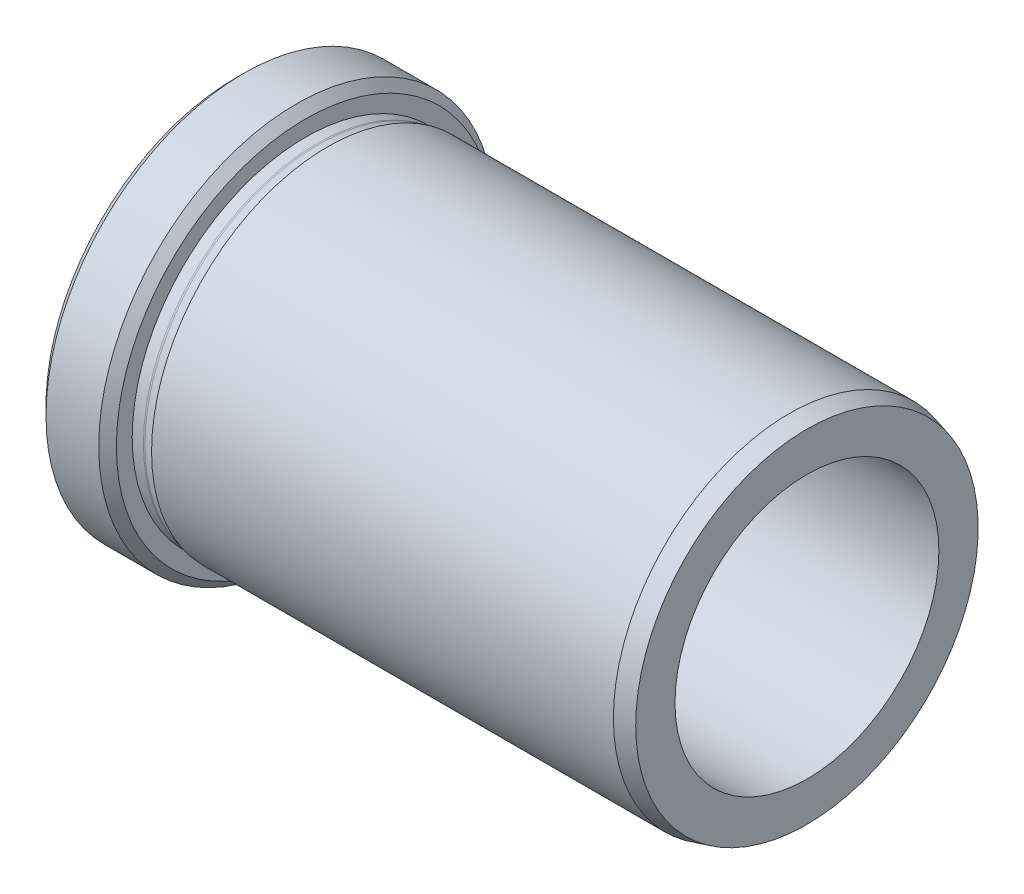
ISO-10303-21;
HEADER;
FILE_DESCRIPTION(('STEP AP214'),'2;1');
FILE_NAME('part.step','',(''),(''),'','','');
FILE_SCHEMA(('AUTOMOTIVE_DESIGN { 1 0 10303 214 1 1 1 1 }'));
ENDSEC;
DATA;
#1=APPLICATION_CONTEXT('core data for automotive mechanical design processes');
#2=APPLICATION_PROTOCOL_DEFINITION('international standard','automotive_design',2000,#1);
#3=PRODUCT_CONTEXT('',#1,'mechanical');
#4=PRODUCT('Part','Part','',(#3));
#5=PRODUCT_RELATED_PRODUCT_CATEGORY('part','',(#4));
#6=PRODUCT_DEFINITION_FORMATION('','',#4);
#7=PRODUCT_DEFINITION_CONTEXT('part definition',#1,'design');
#8=PRODUCT_DEFINITION('design','',#6,#7);
#9=PRODUCT_DEFINITION_SHAPE('','',#8);
#10=(LENGTH_UNIT() NAMED_UNIT(*) SI_UNIT(.MILLI.,.METRE.));
#11=(NAMED_UNIT(*) PLANE_ANGLE_UNIT() SI_UNIT($,.RADIAN.));
#12=(NAMED_UNIT(*) SI_UNIT($,.STERADIAN.) SOLID_ANGLE_UNIT());
#13=UNCERTAINTY_MEASURE_WITH_UNIT(LENGTH_MEASURE(1.E-05),#10,'distance_accuracy_value','');
#14=(GEOMETRIC_REPRESENTATION_CONTEXT(3) GLOBAL_UNCERTAINTY_ASSIGNED_CONTEXT((#13)) GLOBAL_UNIT_ASSIGNED_CONTEXT((#10,
#11,#12)) REPRESENTATION_CONTEXT('',''));
#15=CARTESIAN_POINT('',(0.,0.,0.));
#16=DIRECTION('',(0.,0.,1.));
#17=DIRECTION('',(1.,0.,0.));
#18=AXIS2_PLACEMENT_3D('',#15,#16,#17);
#19=CARTESIAN_POINT('',(20.075539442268,0.,0.));
#20=DIRECTION('',(-1.,0.,0.));
#21=DIRECTION('',(0.,0.,1.));
#22=AXIS2_PLACEMENT_3D('',#19,#20,#21);
#23=TOROIDAL_SURFACE('',#22,20.5,0.8);
#24=CARTESIAN_POINT('',(20.075539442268,0.,0.));
#25=DIRECTION('',(-1.,0.,0.));
#26=DIRECTION('',(0.,0.,1.));
#27=AXIS2_PLACEMENT_3D('',#24,#25,#26);
#28=CIRCLE('',#27,19.7);
#29=CARTESIAN_POINT('',(20.075539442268,0.,19.7));
#30=VERTEX_POINT('',#29);
#31=EDGE_CURVE('E58',#30,#30,#28,.T.);
#32=ORIENTED_EDGE('',*,*,#31,.F.);
#33=EDGE_LOOP('',(#32));
#34=FACE_BOUND('',#33,.T.);
#35=CARTESIAN_POINT('',(20.28259467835,0.,0.));
#36=DIRECTION('',(-1.,0.,0.));
#37=DIRECTION('',(0.,0.,1.));
#38=AXIS2_PLACEMENT_3D('',#35,#36,#37);
#39=CIRCLE('',#38,19.7272593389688);
#40=CARTESIAN_POINT('',(20.28259467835,0.,19.7272593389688));
#41=VERTEX_POINT('',#40);
#42=EDGE_CURVE('E40',#41,#41,#39,.T.);
#43=ORIENTED_EDGE('',*,*,#42,.T.);
#44=EDGE_LOOP('',(#43));
#45=FACE_BOUND('',#44,.T.);
#46=ADVANCED_FACE('F14',(#34,#45),#23,.F.);
#47=CARTESIAN_POINT('',(21.3004766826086,0.,0.));
#48=DIRECTION('',(1.,0.,0.));
#49=DIRECTION('',(0.,0.,-1.));
#50=AXIS2_PLACEMENT_3D('',#47,#48,#49);
#51=CONICAL_SURFACE('',#50,20.,0.261799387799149);
#52=ORIENTED_EDGE('',*,*,#42,.F.);
#53=EDGE_LOOP('',(#52));
#54=FACE_BOUND('',#53,.T.);
#55=CARTESIAN_POINT('',(21.3004766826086,0.,0.));
#56=DIRECTION('',(-1.,0.,0.));
#57=DIRECTION('',(0.,0.,1.));
#58=AXIS2_PLACEMENT_3D('',#55,#56,#57);
#59=CIRCLE('',#58,20.);
#60=CARTESIAN_POINT('',(21.3004766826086,0.,20.));
#61=VERTEX_POINT('',#60);
#62=EDGE_CURVE('E43',#61,#61,#59,.T.);
#63=ORIENTED_EDGE('',*,*,#62,.T.);
#64=EDGE_LOOP('',(#63));
#65=FACE_BOUND('',#64,.T.);
#66=ADVANCED_FACE('F66',(#54,#65),#51,.T.);
#67=CARTESIAN_POINT('',(0.,0.,0.));
#68=DIRECTION('',(-1.,0.,0.));
#69=DIRECTION('',(0.,0.,1.));
#70=AXIS2_PLACEMENT_3D('',#67,#68,#69);
#71=CYLINDRICAL_SURFACE('',#70,20.);
#72=ORIENTED_EDGE('',*,*,#62,.F.);
#73=EDGE_LOOP('',(#72));
#74=FACE_BOUND('',#73,.T.);
#75=CARTESIAN_POINT('',(73.8004766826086,0.,0.));
#76=DIRECTION('',(-1.,0.,0.));
#77=DIRECTION('',(0.,0.,1.));
#78=AXIS2_PLACEMENT_3D('',#75,#76,#77);
#79=CIRCLE('',#78,20.);
#80=CARTESIAN_POINT('',(73.8004766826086,0.,20.));
#81=VERTEX_POINT('',#80);
#82=EDGE_CURVE('E46',#81,#81,#79,.T.);
#83=ORIENTED_EDGE('',*,*,#82,.T.);
#84=EDGE_LOOP('',(#83));
#85=FACE_BOUND('',#84,.T.);
#86=ADVANCED_FACE('F72',(#74,#85),#71,.T.);
#87=CARTESIAN_POINT('',(75.8004766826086,0.,0.));
#88=DIRECTION('',(-1.,0.,0.));
#89=DIRECTION('',(0.,0.,1.));
#90=AXIS2_PLACEMENT_3D('',#87,#88,#89);
#91=CONICAL_SURFACE('',#90,19.4641016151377,0.261799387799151);
#92=ORIENTED_EDGE('',*,*,#82,.F.);
#93=EDGE_LOOP('',(#92));
#94=FACE_BOUND('',#93,.T.);
#95=CARTESIAN_POINT('',(75.8004766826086,0.,0.));
#96=DIRECTION('',(-1.,0.,0.));
#97=DIRECTION('',(0.,0.,1.));
#98=AXIS2_PLACEMENT_3D('',#95,#96,#97);
#99=CIRCLE('',#98,19.4641016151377);
#100=CARTESIAN_POINT('',(75.8004766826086,0.,19.4641016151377));
#101=VERTEX_POINT('',#100);
#102=EDGE_CURVE('E49',#101,#101,#99,.T.);
#103=ORIENTED_EDGE('',*,*,#102,.T.);
#104=EDGE_LOOP('',(#103));
#105=FACE_BOUND('',#104,.T.);
#106=ADVANCED_FACE('F78',(#94,#105),#91,.T.);
#107=CARTESIAN_POINT('',(75.8004766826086,19.4641016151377,0.));
#108=DIRECTION('',(-1.,0.,0.));
#109=DIRECTION('',(0.,0.,1.));
#110=AXIS2_PLACEMENT_3D('',#107,#108,#109);
#111=PLANE('',#110);
#112=ORIENTED_EDGE('',*,*,#102,.F.);
#113=EDGE_LOOP('',(#112));
#114=FACE_BOUND('',#113,.T.);
#115=CARTESIAN_POINT('',(75.8004766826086,0.,0.));
#116=DIRECTION('',(-1.,0.,0.));
#117=DIRECTION('',(0.,0.,1.));
#118=AXIS2_PLACEMENT_3D('',#115,#116,#117);
#119=CIRCLE('',#118,15.);
#120=CARTESIAN_POINT('',(75.8004766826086,0.,15.));
#121=VERTEX_POINT('',#120);
#122=EDGE_CURVE('E52',#121,#121,#119,.T.);
#123=ORIENTED_EDGE('',*,*,#122,.T.);
#124=EDGE_LOOP('',(#123));
#125=FACE_BOUND('',#124,.T.);
#126=ADVANCED_FACE('F84',(#114,#125),#111,.F.);
#127=CARTESIAN_POINT('',(0.,0.,0.));
#128=DIRECTION('',(-1.,0.,0.));
#129=DIRECTION('',(0.,0.,1.));
#130=AXIS2_PLACEMENT_3D('',#127,#128,#129);
#131=CYLINDRICAL_SURFACE('',#130,15.);
#132=CARTESIAN_POINT('',(12.3004766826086,0.,0.));
#133=DIRECTION('',(1.,0.,0.));
#134=DIRECTION('',(0.,0.,-1.));
#135=AXIS2_PLACEMENT_3D('',#132,#133,#134);
#136=CIRCLE('',#135,15.);
#137=CARTESIAN_POINT('',(12.3004766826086,0.,-15.));
#138=VERTEX_POINT('',#137);
#139=EDGE_CURVE('E29',#138,#138,#136,.F.);
#140=ORIENTED_EDGE('',*,*,#139,.T.);
#141=EDGE_LOOP('',(#140));
#142=FACE_BOUND('',#141,.T.);
#143=ORIENTED_EDGE('',*,*,#122,.F.);
#144=EDGE_LOOP('',(#143));
#145=FACE_BOUND('',#144,.T.);
#146=ADVANCED_FACE('F90',(#142,#145),#131,.F.);
#147=CARTESIAN_POINT('',(10.8004766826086,22.5,0.));
#148=DIRECTION('',(1.,0.,0.));
#149=DIRECTION('',(0.,0.,-1.));
#150=AXIS2_PLACEMENT_3D('',#147,#148,#149);
#151=PLANE('',#150);
#152=CARTESIAN_POINT('',(10.8004766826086,0.,0.));
#153=DIRECTION('',(1.,0.,0.));
#154=DIRECTION('',(0.,0.,-1.));
#155=AXIS2_PLACEMENT_3D('',#152,#153,#154);
#156=CIRCLE('',#155,16.5);
#157=CARTESIAN_POINT('',(10.8004766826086,0.,-16.5));
#158=VERTEX_POINT('',#157);
#159=EDGE_CURVE('E25',#158,#158,#156,.T.);
#160=ORIENTED_EDGE('',*,*,#159,.T.);
#161=EDGE_LOOP('',(#160));
#162=FACE_BOUND('',#161,.T.);
#163=CARTESIAN_POINT('',(10.8004766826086,0.,0.));
#164=DIRECTION('',(1.,0.,0.));
#165=DIRECTION('',(0.,0.,-1.));
#166=AXIS2_PLACEMENT_3D('',#163,#164,#165);
#167=CIRCLE('',#166,21.5);
#168=CARTESIAN_POINT('',(10.8004766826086,0.,-21.5));
#169=VERTEX_POINT('',#168);
#170=EDGE_CURVE('E37',#169,#169,#167,.F.);
#171=ORIENTED_EDGE('',*,*,#170,.T.);
#172=EDGE_LOOP('',(#171));
#173=FACE_BOUND('',#172,.T.);
#174=ADVANCED_FACE('F95',(#162,#173),#151,.F.);
#175=CARTESIAN_POINT('',(0.,0.,0.));
#176=DIRECTION('',(-1.,0.,0.));
#177=DIRECTION('',(0.,0.,1.));
#178=AXIS2_PLACEMENT_3D('',#175,#176,#177);
#179=CYLINDRICAL_SURFACE('',#178,22.5);
#180=CARTESIAN_POINT('',(17.8004766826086,0.,0.));
#181=DIRECTION('',(-1.,0.,0.));
#182=DIRECTION('',(0.,0.,1.));
#183=AXIS2_PLACEMENT_3D('',#180,#181,#182);
#184=CIRCLE('',#183,22.5);
#185=CARTESIAN_POINT('',(17.8004766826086,0.,22.5));
#186=VERTEX_POINT('',#185);
#187=EDGE_CURVE('E21',#186,#186,#184,.T.);
#188=ORIENTED_EDGE('',*,*,#187,.T.);
#189=EDGE_LOOP('',(#188));
#190=FACE_BOUND('',#189,.T.);
#191=CARTESIAN_POINT('',(11.8004766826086,0.,0.));
#192=DIRECTION('',(1.,0.,0.));
#193=DIRECTION('',(0.,0.,-1.));
#194=AXIS2_PLACEMENT_3D('',#191,#192,#193);
#195=CIRCLE('',#194,22.5);
#196=CARTESIAN_POINT('',(11.8004766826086,0.,-22.5));
#197=VERTEX_POINT('',#196);
#198=EDGE_CURVE('E34',#197,#197,#195,.T.);
#199=ORIENTED_EDGE('',*,*,#198,.T.);
#200=EDGE_LOOP('',(#199));
#201=FACE_BOUND('',#200,.T.);
#202=ADVANCED_FACE('F103',(#190,#201),#179,.T.);
#203=CARTESIAN_POINT('',(18.8004766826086,22.5,0.));
#204=DIRECTION('',(-1.,0.,0.));
#205=DIRECTION('',(0.,0.,1.));
#206=AXIS2_PLACEMENT_3D('',#203,#204,#205);
#207=PLANE('',#206);
#208=CARTESIAN_POINT('',(18.8004766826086,0.,0.));
#209=DIRECTION('',(-1.,0.,0.));
#210=DIRECTION('',(0.,0.,1.));
#211=AXIS2_PLACEMENT_3D('',#208,#209,#210);
#212=CIRCLE('',#211,21.5);
#213=CARTESIAN_POINT('',(18.8004766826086,0.,21.5));
#214=VERTEX_POINT('',#213);
#215=EDGE_CURVE('E9',#214,#214,#212,.F.);
#216=ORIENTED_EDGE('',*,*,#215,.T.);
#217=EDGE_LOOP('',(#216));
#218=FACE_BOUND('',#217,.T.);
#219=CARTESIAN_POINT('',(18.8004766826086,0.,0.));
#220=DIRECTION('',(-1.,0.,0.));
#221=DIRECTION('',(0.,0.,1.));
#222=AXIS2_PLACEMENT_3D('',#219,#220,#221);
#223=CIRCLE('',#222,19.7);
#224=CARTESIAN_POINT('',(18.8004766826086,0.,19.7));
#225=VERTEX_POINT('',#224);
#226=EDGE_CURVE('E55',#225,#225,#223,.T.);
#227=ORIENTED_EDGE('',*,*,#226,.T.);
#228=EDGE_LOOP('',(#227));
#229=FACE_BOUND('',#228,.T.);
#230=ADVANCED_FACE('F142',(#218,#229),#207,.F.);
#231=CARTESIAN_POINT('',(0.,0.,0.));
#232=DIRECTION('',(-1.,0.,0.));
#233=DIRECTION('',(0.,0.,1.));
#234=AXIS2_PLACEMENT_3D('',#231,#232,#233);
#235=CYLINDRICAL_SURFACE('',#234,19.7);
#236=ORIENTED_EDGE('',*,*,#226,.F.);
#237=EDGE_LOOP('',(#236));
#238=FACE_BOUND('',#237,.T.);
#239=ORIENTED_EDGE('',*,*,#31,.T.);
#240=EDGE_LOOP('',(#239));
#241=FACE_BOUND('',#240,.T.);
#242=ADVANCED_FACE('F62',(#238,#241),#235,.T.);
#243=CARTESIAN_POINT('',(10.8004766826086,0.,0.));
#244=DIRECTION('',(1.,0.,0.));
#245=DIRECTION('',(0.,0.,-1.));
#246=AXIS2_PLACEMENT_3D('',#243,#244,#245);
#247=CONICAL_SURFACE('',#246,21.5,0.785398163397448);
#248=ORIENTED_EDGE('',*,*,#198,.F.);
#249=EDGE_LOOP('',(#248));
#250=FACE_BOUND('',#249,.T.);
#251=ORIENTED_EDGE('',*,*,#170,.F.);
#252=EDGE_LOOP('',(#251));
#253=FACE_BOUND('',#252,.T.);
#254=ADVANCED_FACE('F108',(#250,#253),#247,.T.);
#255=CARTESIAN_POINT('',(12.3004766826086,0.,0.));
#256=DIRECTION('',(1.,0.,0.));
#257=DIRECTION('',(0.,0.,-1.));
#258=AXIS2_PLACEMENT_3D('',#255,#256,#257);
#259=TOROIDAL_SURFACE('',#258,16.5,1.5);
#260=ORIENTED_EDGE('',*,*,#159,.F.);
#261=EDGE_LOOP('',(#260));
#262=FACE_BOUND('',#261,.T.);
#263=ORIENTED_EDGE('',*,*,#139,.F.);
#264=EDGE_LOOP('',(#263));
#265=FACE_BOUND('',#264,.T.);
#266=ADVANCED_FACE('F110',(#262,#265),#259,.T.);
#267=CARTESIAN_POINT('',(17.8004766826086,0.,0.));
#268=DIRECTION('',(-1.,0.,0.));
#269=DIRECTION('',(0.,0.,1.));
#270=AXIS2_PLACEMENT_3D('',#267,#268,#269);
#271=CONICAL_SURFACE('',#270,22.5,0.785398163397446);
#272=ORIENTED_EDGE('',*,*,#215,.F.);
#273=EDGE_LOOP('',(#272));
#274=FACE_BOUND('',#273,.T.);
#275=ORIENTED_EDGE('',*,*,#187,.F.);
#276=EDGE_LOOP('',(#275));
#277=FACE_BOUND('',#276,.T.);
#278=ADVANCED_FACE('F16',(#274,#277),#271,.T.);
#279=CLOSED_SHELL('',(#46,#66,#86,#106,#126,#146,#174,#202,#230,#242,#254,#266,#278));
#280=MANIFOLD_SOLID_BREP('B1',#279);
#281=ADVANCED_BREP_SHAPE_REPRESENTATION('',(#18,#280),#14);
#282=SHAPE_DEFINITION_REPRESENTATION(#9,#281);
ENDSEC;
END-ISO-10303-21;
